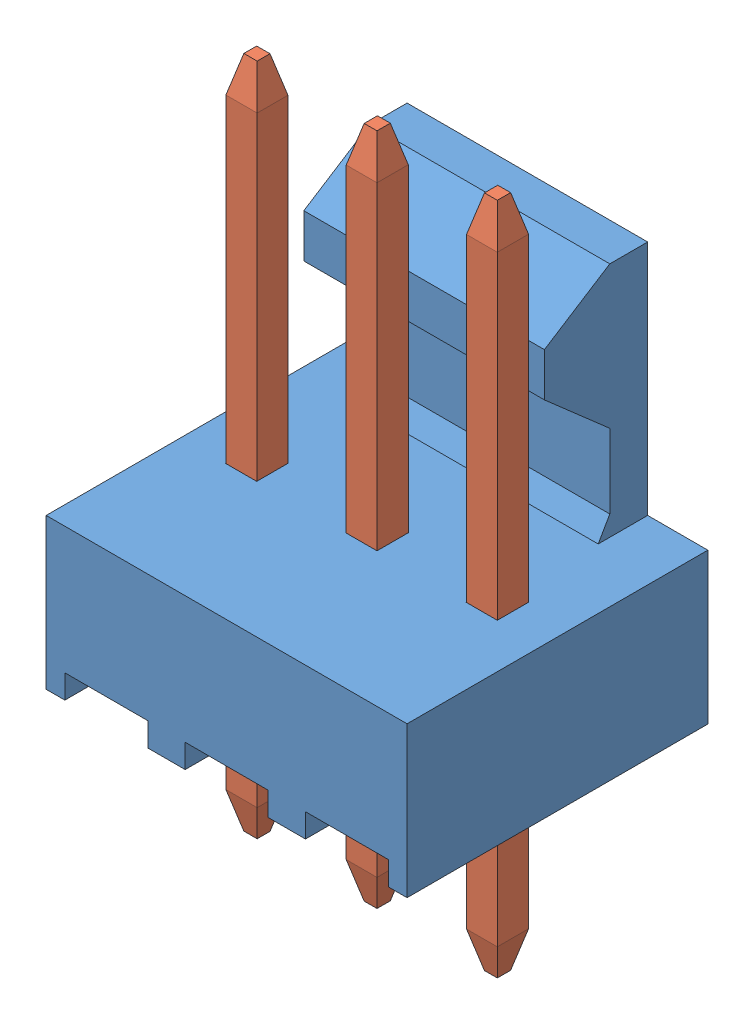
SolidWorks assembly Molex - 3-Pin Header with Lock (0.100in pitch).sldasm, configuration Default (file format 4400). Lengths in mm.
Overall size (7.62 14.22 6.35).
4 component instances, 2 part files, 9 mates.
Components (placement in the parent):
- Molex - 3-Pin Header Base with Lock (0.100in pitch)-1: Molex - 3-Pin Header Base with Lock (0.100in pitch).SLDPRT [Default] at (-26.997 -8.9953 22.914) size (7.62 8.18 6.35)
- Molex - Header Pin-2: Molex - Header Pin.SLDPRT [Default] at (-29.207 -15.7253 20.059) x (0 0 -1) z (1 0 0) size (0.65 14.22 0.66)
- Molex - Header Pin-3: Molex - Header Pin.SLDPRT [Default] at (-26.667 -15.7253 19.409) x (-1 0 0) z (0 0 -1) size (0.65 14.22 0.66)
- Molex - Header Pin-4: Molex - Header Pin.SLDPRT [Default] at (-24.777 -15.7253 20.069) size (0.65 14.22 0.66)
Mates (geometry in assembly coordinates):
- Coincident3: coincident anti-aligned: plane of Molex - 3-Pin Header Base with Lock (0.100in pitch)-1 through (-29.867 -12.1763 19.409) normal (0 0 1); plane of Molex - Header Pin-2 through (-29.207 -1.5053 19.409) normal (0 0 -1)
- Coincident4: coincident anti-aligned: plane of Molex - 3-Pin Header Base with Lock (0.100in pitch)-1 through (-29.207 -12.1763 19.409) normal (-1 0 0); plane of Molex - Header Pin-2 through (-29.207 -15.7253 19.409) normal (1 0 0)
- Coincident5: coincident: plane of Molex - 3-Pin Header Base with Lock (0.100in pitch)-1 through (-27.327 -12.1763 19.409) normal (0 0 1); plane of Molex - Header Pin-3
- Coincident6: coincident: plane of Molex - 3-Pin Header Base with Lock (0.100in pitch)-1 through (-24.787 -12.1763 19.409) normal (0 0 1); plane of Molex - Header Pin-4 through (-24.127 -15.7253 19.409) normal (0 0 -1)
- Coincident7: coincident: plane of Molex - 3-Pin Header Base with Lock (0.100in pitch)-1 through (-24.127 -12.1763 19.409) normal (-1 0 0); plane of Molex - Header Pin-4
- Coincident8: coincident: plane of Molex - 3-Pin Header Base with Lock (0.100in pitch)-1 through (-26.667 -12.1763 19.409) normal (-1 0 0); plane of Molex - Header Pin-3 through (-26.667 -1.5053 19.409) normal (1 0 0)
- Distance1: distance = 7.49 mm aligned: plane of Molex - 3-Pin Header Base with Lock (0.100in pitch)-1 through (-30.807 -8.9953 16.564) normal (0 1 0); plane of Molex - Header Pin-2 through (-29.207 -1.5053 19.409) normal (0 1 0)
- Distance2: distance = 7.49 mm aligned: plane of Molex - 3-Pin Header Base with Lock (0.100in pitch)-1; plane of Molex - Header Pin-3
- Distance3: distance = 7.49 mm aligned: plane of Molex - 3-Pin Header Base with Lock (0.100in pitch)-1; plane of Molex - Header Pin-4
